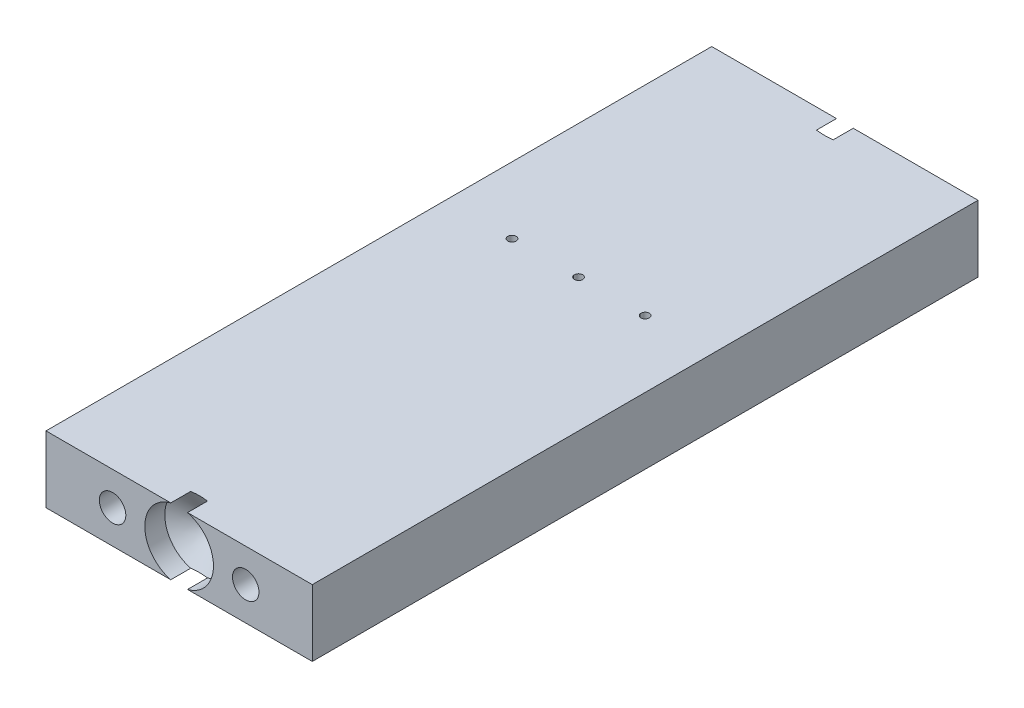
ISO-10303-21;
HEADER;
FILE_DESCRIPTION(('STEP AP214'),'2;1');
FILE_NAME('part.step','',(''),(''),'','','');
FILE_SCHEMA(('AUTOMOTIVE_DESIGN { 1 0 10303 214 1 1 1 1 }'));
ENDSEC;
DATA;
#1=APPLICATION_CONTEXT('core data for automotive mechanical design processes');
#2=APPLICATION_PROTOCOL_DEFINITION('international standard','automotive_design',2000,#1);
#3=PRODUCT_CONTEXT('',#1,'mechanical');
#4=PRODUCT('Part','Part','',(#3));
#5=PRODUCT_RELATED_PRODUCT_CATEGORY('part','',(#4));
#6=PRODUCT_DEFINITION_FORMATION('','',#4);
#7=PRODUCT_DEFINITION_CONTEXT('part definition',#1,'design');
#8=PRODUCT_DEFINITION('design','',#6,#7);
#9=PRODUCT_DEFINITION_SHAPE('','',#8);
#10=(LENGTH_UNIT() NAMED_UNIT(*) SI_UNIT(.MILLI.,.METRE.));
#11=(NAMED_UNIT(*) PLANE_ANGLE_UNIT() SI_UNIT($,.RADIAN.));
#12=(NAMED_UNIT(*) SI_UNIT($,.STERADIAN.) SOLID_ANGLE_UNIT());
#13=UNCERTAINTY_MEASURE_WITH_UNIT(LENGTH_MEASURE(1.E-05),#10,'distance_accuracy_value','');
#14=(GEOMETRIC_REPRESENTATION_CONTEXT(3) GLOBAL_UNCERTAINTY_ASSIGNED_CONTEXT((#13)) GLOBAL_UNIT_ASSIGNED_CONTEXT((#10,
#11,#12)) REPRESENTATION_CONTEXT('',''));
#15=CARTESIAN_POINT('',(0.,0.,0.));
#16=DIRECTION('',(0.,0.,1.));
#17=DIRECTION('',(1.,0.,0.));
#18=AXIS2_PLACEMENT_3D('',#15,#16,#17);
#19=CARTESIAN_POINT('',(-25.4,12.7,-63.5));
#20=DIRECTION('',(0.,0.,1.));
#21=DIRECTION('',(1.,0.,0.));
#22=AXIS2_PLACEMENT_3D('',#19,#20,#21);
#23=PLANE('',#22);
#24=CARTESIAN_POINT('',(-12.7,6.35,-63.5));
#25=DIRECTION('',(0.,0.,-1.));
#26=DIRECTION('',(-1.,0.,0.));
#27=AXIS2_PLACEMENT_3D('',#24,#25,#26);
#28=CIRCLE('',#27,2.52729999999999);
#29=CARTESIAN_POINT('',(-15.2273,6.35,-63.5));
#30=VERTEX_POINT('',#29);
#31=EDGE_CURVE('E582',#30,#30,#28,.T.);
#32=ORIENTED_EDGE('',*,*,#31,.F.);
#33=EDGE_LOOP('',(#32));
#34=FACE_BOUND('',#33,.T.);
#35=DIRECTION('',(-1.,0.,0.));
#36=VECTOR('',#35,1.);
#37=CARTESIAN_POINT('',(-25.4,12.7,-63.5));
#38=LINE('',#37,#36);
#39=CARTESIAN_POINT('',(-1.60011416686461,12.7,-63.5));
#40=VERTEX_POINT('',#39);
#41=CARTESIAN_POINT('',(-25.4,12.7,-63.5));
#42=VERTEX_POINT('',#41);
#43=EDGE_CURVE('E318',#40,#42,#38,.T.);
#44=ORIENTED_EDGE('',*,*,#43,.F.);
#45=CARTESIAN_POINT('',(0.,6.35,-63.5));
#46=DIRECTION('',(0.,0.,-1.));
#47=DIRECTION('',(-1.,0.,0.));
#48=AXIS2_PLACEMENT_3D('',#45,#46,#47);
#49=CIRCLE('',#48,6.54850099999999);
#50=CARTESIAN_POINT('',(-1.60011416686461,0.,-63.5));
#51=VERTEX_POINT('',#50);
#52=EDGE_CURVE('E263',#51,#40,#49,.T.);
#53=ORIENTED_EDGE('',*,*,#52,.F.);
#54=DIRECTION('',(-1.,0.,0.));
#55=VECTOR('',#54,1.);
#56=CARTESIAN_POINT('',(-25.4,0.,-63.5));
#57=LINE('',#56,#55);
#58=CARTESIAN_POINT('',(-25.4,0.,-63.5));
#59=VERTEX_POINT('',#58);
#60=EDGE_CURVE('E192',#51,#59,#57,.T.);
#61=ORIENTED_EDGE('',*,*,#60,.T.);
#62=DIRECTION('',(0.,-1.,0.));
#63=VECTOR('',#62,1.);
#64=CARTESIAN_POINT('',(-25.4,12.7,-63.5));
#65=LINE('',#64,#63);
#66=EDGE_CURVE('E211',#42,#59,#65,.T.);
#67=ORIENTED_EDGE('',*,*,#66,.F.);
#68=EDGE_LOOP('',(#44,#53,#61,#67));
#69=FACE_BOUND('',#68,.T.);
#70=ADVANCED_FACE('F37',(#34,#69),#23,.F.);
#71=CARTESIAN_POINT('',(-25.4,12.7,63.5));
#72=DIRECTION('',(0.,0.,-1.));
#73=DIRECTION('',(-1.,0.,0.));
#74=AXIS2_PLACEMENT_3D('',#71,#72,#73);
#75=PLANE('',#74);
#76=CARTESIAN_POINT('',(12.7,6.35,63.5));
#77=DIRECTION('',(0.,0.,1.));
#78=DIRECTION('',(1.,0.,0.));
#79=AXIS2_PLACEMENT_3D('',#76,#77,#78);
#80=CIRCLE('',#79,2.52729999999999);
#81=CARTESIAN_POINT('',(15.2273,6.35,63.5));
#82=VERTEX_POINT('',#81);
#83=EDGE_CURVE('E579',#82,#82,#80,.T.);
#84=ORIENTED_EDGE('',*,*,#83,.F.);
#85=EDGE_LOOP('',(#84));
#86=FACE_BOUND('',#85,.T.);
#87=DIRECTION('',(1.,0.,0.));
#88=VECTOR('',#87,1.);
#89=CARTESIAN_POINT('',(-25.4,12.7,63.5));
#90=LINE('',#89,#88);
#91=CARTESIAN_POINT('',(1.60011416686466,12.7,63.5));
#92=VERTEX_POINT('',#91);
#93=CARTESIAN_POINT('',(25.4,12.7,63.5));
#94=VERTEX_POINT('',#93);
#95=EDGE_CURVE('E327',#92,#94,#90,.T.);
#96=ORIENTED_EDGE('',*,*,#95,.F.);
#97=CARTESIAN_POINT('',(0.,6.35,63.5));
#98=DIRECTION('',(0.,0.,-1.));
#99=DIRECTION('',(-1.,0.,0.));
#100=AXIS2_PLACEMENT_3D('',#97,#98,#99);
#101=CIRCLE('',#100,6.548501);
#102=CARTESIAN_POINT('',(1.60011416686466,0.,63.5));
#103=VERTEX_POINT('',#102);
#104=EDGE_CURVE('E285',#92,#103,#101,.T.);
#105=ORIENTED_EDGE('',*,*,#104,.T.);
#106=DIRECTION('',(1.,0.,0.));
#107=VECTOR('',#106,1.);
#108=CARTESIAN_POINT('',(-25.4,0.,63.5));
#109=LINE('',#108,#107);
#110=CARTESIAN_POINT('',(25.4,0.,63.5));
#111=VERTEX_POINT('',#110);
#112=EDGE_CURVE('E194',#103,#111,#109,.T.);
#113=ORIENTED_EDGE('',*,*,#112,.T.);
#114=DIRECTION('',(0.,-1.,0.));
#115=VECTOR('',#114,1.);
#116=CARTESIAN_POINT('',(25.4,12.7,63.5));
#117=LINE('',#116,#115);
#118=EDGE_CURVE('E204',#94,#111,#117,.T.);
#119=ORIENTED_EDGE('',*,*,#118,.F.);
#120=EDGE_LOOP('',(#96,#105,#113,#119));
#121=FACE_BOUND('',#120,.T.);
#122=ADVANCED_FACE('F154',(#86,#121),#75,.F.);
#123=CARTESIAN_POINT('',(25.4,12.7,63.5));
#124=DIRECTION('',(-1.,0.,0.));
#125=DIRECTION('',(0.,0.,1.));
#126=AXIS2_PLACEMENT_3D('',#123,#124,#125);
#127=PLANE('',#126);
#128=DIRECTION('',(0.,0.,-1.));
#129=VECTOR('',#128,1.);
#130=CARTESIAN_POINT('',(25.4,0.,63.5));
#131=LINE('',#130,#129);
#132=CARTESIAN_POINT('',(25.4,0.,-63.5));
#133=VERTEX_POINT('',#132);
#134=EDGE_CURVE('E196',#111,#133,#131,.T.);
#135=ORIENTED_EDGE('',*,*,#134,.T.);
#136=DIRECTION('',(0.,-1.,0.));
#137=VECTOR('',#136,1.);
#138=CARTESIAN_POINT('',(25.4,12.7,-63.5));
#139=LINE('',#138,#137);
#140=CARTESIAN_POINT('',(25.4,12.7,-63.5));
#141=VERTEX_POINT('',#140);
#142=EDGE_CURVE('E186',#141,#133,#139,.T.);
#143=ORIENTED_EDGE('',*,*,#142,.F.);
#144=DIRECTION('',(0.,0.,-1.));
#145=VECTOR('',#144,1.);
#146=CARTESIAN_POINT('',(25.4,12.7,63.5));
#147=LINE('',#146,#145);
#148=EDGE_CURVE('E203',#94,#141,#147,.T.);
#149=ORIENTED_EDGE('',*,*,#148,.F.);
#150=ORIENTED_EDGE('',*,*,#118,.T.);
#151=EDGE_LOOP('',(#135,#143,#149,#150));
#152=FACE_BOUND('',#151,.T.);
#153=ADVANCED_FACE('F39',(#152),#127,.F.);
#154=CARTESIAN_POINT('',(12.7,6.35,-63.5));
#155=DIRECTION('',(0.,0.,-1.));
#156=DIRECTION('',(-1.,0.,0.));
#157=AXIS2_PLACEMENT_3D('',#154,#155,#156);
#158=CIRCLE('',#157,2.52729999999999);
#159=CARTESIAN_POINT('',(10.1727,6.35,-63.5));
#160=VERTEX_POINT('',#159);
#161=EDGE_CURVE('E178',#160,#160,#158,.T.);
#162=ORIENTED_EDGE('',*,*,#161,.F.);
#163=EDGE_LOOP('',(#162));
#164=FACE_BOUND('',#163,.T.);
#165=CARTESIAN_POINT('',(1.60011416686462,0.,-63.5));
#166=VERTEX_POINT('',#165);
#167=EDGE_CURVE('E182',#133,#166,#57,.T.);
#168=ORIENTED_EDGE('',*,*,#167,.T.);
#169=CARTESIAN_POINT('',(1.60011416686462,12.7,-63.5));
#170=VERTEX_POINT('',#169);
#171=EDGE_CURVE('E183',#170,#166,#49,.T.);
#172=ORIENTED_EDGE('',*,*,#171,.F.);
#173=EDGE_CURVE('E320',#141,#170,#38,.T.);
#174=ORIENTED_EDGE('',*,*,#173,.F.);
#175=ORIENTED_EDGE('',*,*,#142,.T.);
#176=EDGE_LOOP('',(#168,#172,#174,#175));
#177=FACE_BOUND('',#176,.T.);
#178=ADVANCED_FACE('F156',(#164,#177),#23,.F.);
#179=CARTESIAN_POINT('',(-25.4,12.7,63.5));
#180=DIRECTION('',(1.,0.,0.));
#181=DIRECTION('',(0.,0.,-1.));
#182=AXIS2_PLACEMENT_3D('',#179,#180,#181);
#183=PLANE('',#182);
#184=DIRECTION('',(0.,0.,1.));
#185=VECTOR('',#184,1.);
#186=CARTESIAN_POINT('',(-25.4,0.,63.5));
#187=LINE('',#186,#185);
#188=CARTESIAN_POINT('',(-25.4,0.,63.5));
#189=VERTEX_POINT('',#188);
#190=EDGE_CURVE('E191',#59,#189,#187,.T.);
#191=ORIENTED_EDGE('',*,*,#190,.T.);
#192=DIRECTION('',(0.,-1.,0.));
#193=VECTOR('',#192,1.);
#194=CARTESIAN_POINT('',(-25.4,12.7,63.5));
#195=LINE('',#194,#193);
#196=CARTESIAN_POINT('',(-25.4,12.7,63.5));
#197=VERTEX_POINT('',#196);
#198=EDGE_CURVE('E207',#197,#189,#195,.T.);
#199=ORIENTED_EDGE('',*,*,#198,.F.);
#200=DIRECTION('',(0.,0.,1.));
#201=VECTOR('',#200,1.);
#202=CARTESIAN_POINT('',(-25.4,12.7,63.5));
#203=LINE('',#202,#201);
#204=EDGE_CURVE('E326',#42,#197,#203,.T.);
#205=ORIENTED_EDGE('',*,*,#204,.F.);
#206=ORIENTED_EDGE('',*,*,#66,.T.);
#207=EDGE_LOOP('',(#191,#199,#205,#206));
#208=FACE_BOUND('',#207,.T.);
#209=ADVANCED_FACE('F167',(#208),#183,.F.);
#210=CARTESIAN_POINT('',(-12.7,6.35,63.5));
#211=DIRECTION('',(0.,0.,1.));
#212=DIRECTION('',(1.,0.,0.));
#213=AXIS2_PLACEMENT_3D('',#210,#211,#212);
#214=CIRCLE('',#213,2.52729999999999);
#215=CARTESIAN_POINT('',(-10.1727,6.35,63.5));
#216=VERTEX_POINT('',#215);
#217=EDGE_CURVE('E573',#216,#216,#214,.T.);
#218=ORIENTED_EDGE('',*,*,#217,.F.);
#219=EDGE_LOOP('',(#218));
#220=FACE_BOUND('',#219,.T.);
#221=CARTESIAN_POINT('',(-1.60011416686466,0.,63.5));
#222=VERTEX_POINT('',#221);
#223=EDGE_CURVE('E200',#189,#222,#109,.T.);
#224=ORIENTED_EDGE('',*,*,#223,.T.);
#225=CARTESIAN_POINT('',(-1.60011416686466,12.7,63.5));
#226=VERTEX_POINT('',#225);
#227=EDGE_CURVE('E286',#222,#226,#101,.T.);
#228=ORIENTED_EDGE('',*,*,#227,.T.);
#229=EDGE_CURVE('E208',#197,#226,#90,.T.);
#230=ORIENTED_EDGE('',*,*,#229,.F.);
#231=ORIENTED_EDGE('',*,*,#198,.T.);
#232=EDGE_LOOP('',(#224,#228,#230,#231));
#233=FACE_BOUND('',#232,.T.);
#234=ADVANCED_FACE('F162',(#220,#233),#75,.F.);
#235=CARTESIAN_POINT('',(0.,12.7,0.));
#236=DIRECTION('',(0.,-1.,0.));
#237=DIRECTION('',(0.,0.,-1.));
#238=AXIS2_PLACEMENT_3D('',#235,#236,#237);
#239=PLANE('',#238);
#240=CARTESIAN_POINT('',(0.,12.7,-12.7));
#241=DIRECTION('',(0.,1.,0.));
#242=DIRECTION('',(0.,0.,1.));
#243=AXIS2_PLACEMENT_3D('',#240,#241,#242);
#244=CIRCLE('',#243,0.793749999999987);
#245=CARTESIAN_POINT('',(0.,12.7,-11.90625));
#246=VERTEX_POINT('',#245);
#247=EDGE_CURVE('E591',#246,#246,#244,.T.);
#248=ORIENTED_EDGE('',*,*,#247,.F.);
#249=EDGE_LOOP('',(#248));
#250=FACE_BOUND('',#249,.T.);
#251=CARTESIAN_POINT('',(12.7,12.7,-12.7));
#252=DIRECTION('',(0.,1.,0.));
#253=DIRECTION('',(0.,0.,1.));
#254=AXIS2_PLACEMENT_3D('',#251,#252,#253);
#255=CIRCLE('',#254,0.793749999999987);
#256=CARTESIAN_POINT('',(12.7,12.7,-11.90625));
#257=VERTEX_POINT('',#256);
#258=EDGE_CURVE('E597',#257,#257,#255,.T.);
#259=ORIENTED_EDGE('',*,*,#258,.F.);
#260=EDGE_LOOP('',(#259));
#261=FACE_BOUND('',#260,.T.);
#262=CARTESIAN_POINT('',(-12.7,12.7,-12.7));
#263=DIRECTION('',(0.,1.,0.));
#264=DIRECTION('',(0.,0.,1.));
#265=AXIS2_PLACEMENT_3D('',#262,#263,#264);
#266=CIRCLE('',#265,0.793749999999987);
#267=CARTESIAN_POINT('',(-12.7,12.7,-11.90625));
#268=VERTEX_POINT('',#267);
#269=EDGE_CURVE('E602',#268,#268,#266,.T.);
#270=ORIENTED_EDGE('',*,*,#269,.F.);
#271=EDGE_LOOP('',(#270));
#272=FACE_BOUND('',#271,.T.);
#273=CARTESIAN_POINT('',(15.4687298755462,12.7,-65.8024743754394));
#274=CARTESIAN_POINT('',(15.0979794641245,12.7,-65.5964182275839));
#275=CARTESIAN_POINT('',(14.7267932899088,12.7,-65.3911404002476));
#276=CARTESIAN_POINT('',(13.9833051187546,12.7,-64.9825803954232));
#277=CARTESIAN_POINT('',(13.6110030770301,12.7,-64.7792982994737));
#278=CARTESIAN_POINT('',(12.8644515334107,12.7,-64.374851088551));
#279=CARTESIAN_POINT('',(12.4901998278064,12.7,-64.1736900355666));
#280=CARTESIAN_POINT('',(11.7400526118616,12.7,-63.7744679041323));
#281=CARTESIAN_POINT('',(11.3641571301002,12.7,-63.5764067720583));
#282=CARTESIAN_POINT('',(10.5925057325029,12.7,-63.1749706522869));
#283=CARTESIAN_POINT('',(10.1966503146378,12.7,-62.9717865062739));
#284=CARTESIAN_POINT('',(9.40206683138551,12.7,-62.5711161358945));
#285=CARTESIAN_POINT('',(9.00333883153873,12.7,-62.3736297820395));
#286=CARTESIAN_POINT('',(8.20242359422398,12.7,-61.9864428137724));
#287=CARTESIAN_POINT('',(7.80023874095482,12.7,-61.796737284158));
#288=CARTESIAN_POINT('',(6.99107792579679,12.7,-61.4278455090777));
#289=CARTESIAN_POINT('',(6.58410254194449,12.7,-61.2486580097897));
#290=CARTESIAN_POINT('',(5.974362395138,12.7,-60.9932789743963));
#291=CARTESIAN_POINT('',(5.77397230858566,12.7,-60.9114190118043));
#292=CARTESIAN_POINT('',(5.37152632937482,12.7,-60.7519129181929));
#293=CARTESIAN_POINT('',(5.1694705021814,12.7,-60.6742666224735));
#294=CARTESIAN_POINT('',(4.76339286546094,12.7,-60.5239484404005));
#295=CARTESIAN_POINT('',(4.55937016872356,12.7,-60.4512789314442));
#296=CARTESIAN_POINT('',(4.14930485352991,12.7,-60.311936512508));
#297=CARTESIAN_POINT('',(3.9432622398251,12.7,-60.2452635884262));
#298=CARTESIAN_POINT('',(3.32644814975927,12.7,-60.0573178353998));
#299=CARTESIAN_POINT('',(2.91236377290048,12.7,-59.9463549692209));
#300=CARTESIAN_POINT('',(2.28519430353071,12.7,-59.808595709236));
#301=CARTESIAN_POINT('',(2.07522529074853,12.7,-59.7674687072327));
#302=CARTESIAN_POINT('',(1.65343490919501,12.7,-59.6960772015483));
#303=CARTESIAN_POINT('',(1.44161375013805,12.7,-59.6658114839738));
#304=CARTESIAN_POINT('',(1.06491203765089,12.7,-59.622796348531));
#305=CARTESIAN_POINT('',(0.900305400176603,12.7,-59.6076291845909));
#306=CARTESIAN_POINT('',(0.570573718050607,12.7,-59.5848367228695));
#307=CARTESIAN_POINT('',(0.405448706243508,12.7,-59.5772109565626));
#308=CARTESIAN_POINT('',(0.0751138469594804,12.7,-59.5697073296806));
#309=CARTESIAN_POINT('',(-0.0900959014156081,12.7,-59.5698251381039));
#310=CARTESIAN_POINT('',(-0.420330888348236,12.7,-59.5777927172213));
#311=CARTESIAN_POINT('',(-0.585356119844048,12.7,-59.5856427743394));
#312=CARTESIAN_POINT('',(-0.945779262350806,12.7,-59.6110507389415));
#313=CARTESIAN_POINT('',(-1.14106956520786,12.7,-59.6301530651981));
#314=CARTESIAN_POINT('',(-1.53040461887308,12.7,-59.6783037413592));
#315=CARTESIAN_POINT('',(-1.7244492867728,12.7,-59.7073527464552));
#316=CARTESIAN_POINT('',(-2.30449482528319,12.7,-59.8081216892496));
#317=CARTESIAN_POINT('',(-2.68817906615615,12.7,-59.8934455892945));
#318=CARTESIAN_POINT('',(-3.26077605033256,12.7,-60.0431077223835));
#319=CARTESIAN_POINT('',(-3.45255626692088,12.7,-60.0970881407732));
#320=CARTESIAN_POINT('',(-3.83428337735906,12.7,-60.211237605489));
#321=CARTESIAN_POINT('',(-4.02423025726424,12.7,-60.2714066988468));
#322=CARTESIAN_POINT('',(-4.40230882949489,12.7,-60.3970044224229));
#323=CARTESIAN_POINT('',(-4.59044096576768,12.7,-60.4624317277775));
#324=CARTESIAN_POINT('',(-4.96507055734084,12.7,-60.5977690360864));
#325=CARTESIAN_POINT('',(-5.15156809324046,12.7,-60.6676788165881));
#326=CARTESIAN_POINT('',(-5.55510433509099,12.7,-60.8236882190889));
#327=CARTESIAN_POINT('',(-5.77186653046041,12.7,-60.9105014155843));
#328=CARTESIAN_POINT('',(-6.20360283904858,12.7,-61.0884755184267));
#329=CARTESIAN_POINT('',(-6.4185768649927,12.7,-61.1796366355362));
#330=CARTESIAN_POINT('',(-7.06123869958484,12.7,-61.4585484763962));
#331=CARTESIAN_POINT('',(-7.48658409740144,12.7,-61.6516952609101));
#332=CARTESIAN_POINT('',(-8.33285962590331,12.7,-62.0482312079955));
#333=CARTESIAN_POINT('',(-8.75378574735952,12.7,-62.2516288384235));
#334=CARTESIAN_POINT('',(-9.59196780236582,12.7,-62.6657224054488));
#335=CARTESIAN_POINT('',(-10.0092241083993,12.7,-62.8764175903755));
#336=CARTESIAN_POINT('',(-10.8422246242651,12.7,-63.3038840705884));
#337=CARTESIAN_POINT('',(-11.2579602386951,12.7,-63.5206720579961));
#338=CARTESIAN_POINT('',(-12.0872544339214,12.7,-63.9583866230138));
#339=CARTESIAN_POINT('',(-12.5008129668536,12.7,-64.1793132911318));
#340=CARTESIAN_POINT('',(-13.3260044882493,12.7,-64.6242550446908));
#341=CARTESIAN_POINT('',(-13.7376383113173,12.7,-64.8482685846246));
#342=CARTESIAN_POINT('',(-14.5595255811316,12.7,-65.2988153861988));
#343=CARTESIAN_POINT('',(-14.9697790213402,12.7,-65.525348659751));
#344=CARTESIAN_POINT('',(-16.1025018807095,12.7,-66.1544328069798));
#345=CARTESIAN_POINT('',(-16.8237947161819,12.7,-66.5591013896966));
#346=CARTESIAN_POINT('',(-18.2640268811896,12.7,-67.372829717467));
#347=CARTESIAN_POINT('',(-18.9829658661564,12.7,-67.7818900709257));
#348=CARTESIAN_POINT('',(-20.4148912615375,12.7,-68.6007916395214));
#349=CARTESIAN_POINT('',(-21.1278880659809,12.7,-69.0106146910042));
#350=CARTESIAN_POINT('',(-22.1963165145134,12.7,-69.6270671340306));
#351=CARTESIAN_POINT('',(-22.5522536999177,12.7,-69.8328214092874));
#352=CARTESIAN_POINT('',(-23.2638300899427,12.7,-70.2448436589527));
#353=CARTESIAN_POINT('',(-23.6194692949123,12.7,-70.4511116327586));
#354=CARTESIAN_POINT('',(-23.9749793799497,12.7,-70.6576019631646));
#355=B_SPLINE_CURVE_WITH_KNOTS('',3,(#273,#274,#275,#276,#277,#278,#279,#280,#281,#282,#283,
#284,#285,#286,#287,#288,#289,#290,#291,#292,#293,#294,#295,#296,#297,#298,#299,#300,#301,#302,
#303,#304,#305,#306,#307,#308,#309,#310,#311,#312,#313,#314,#315,#316,#317,#318,#319,#320,#321,
#322,#323,#324,#325,#326,#327,#328,#329,#330,#331,#332,#333,#334,#335,#336,#337,#338,#339,#340,
#341,#342,#343,#344,#345,#346,#347,#348,#349,#350,#351,#352,#353,#354),.UNSPECIFIED.,.F.,.F.,(4,
2,2,2,2,2,2,2,2,2,2,2,2,2,2,2,2,2,2,2,2,2,2,2,2,2,2,2,2,2,2,2,2,2,2,2,2,2,2,2,4),(0.,
1.27249489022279,2.54504155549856,3.81969501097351,5.09432639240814,6.42915913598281,
7.7639615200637,9.09790728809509,10.4316937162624,11.0810513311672,11.7303835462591,
12.3800238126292,13.0296625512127,14.3141084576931,14.9557615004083,15.5973428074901,
16.0930964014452,16.5888191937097,17.0842647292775,17.5797286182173,18.1681048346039,
18.7565198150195,19.9340335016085,20.5316700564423,21.1293111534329,21.7268021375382,
22.3242634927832,23.0247054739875,23.7251814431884,25.1263982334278,26.5287921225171,
27.9310419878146,29.3376038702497,30.74419654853,32.1501088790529,33.5560278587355,
36.037168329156,38.5186570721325,40.9858099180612,42.2191931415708,43.4525749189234),.UNSPECIFIED.);
#356=CARTESIAN_POINT('',(1.60011416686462,12.7,-59.69));
#357=VERTEX_POINT('',#356);
#358=CARTESIAN_POINT('',(-1.60011416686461,12.7,-59.69));
#359=VERTEX_POINT('',#358);
#360=EDGE_CURVE('E278',#357,#359,#355,.T.);
#361=ORIENTED_EDGE('',*,*,#360,.T.);
#362=DIRECTION('',(0.,0.,-1.));
#363=VECTOR('',#362,1.);
#364=CARTESIAN_POINT('',(-1.60011416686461,12.7,-63.5));
#365=LINE('',#364,#363);
#366=EDGE_CURVE('E274',#359,#40,#365,.T.);
#367=ORIENTED_EDGE('',*,*,#366,.T.);
#368=ORIENTED_EDGE('',*,*,#43,.T.);
#369=ORIENTED_EDGE('',*,*,#204,.T.);
#370=ORIENTED_EDGE('',*,*,#229,.T.);
#371=DIRECTION('',(0.,0.,1.));
#372=VECTOR('',#371,1.);
#373=CARTESIAN_POINT('',(-1.60011416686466,12.7,63.5));
#374=LINE('',#373,#372);
#375=CARTESIAN_POINT('',(-1.60011416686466,12.7,59.69));
#376=VERTEX_POINT('',#375);
#377=EDGE_CURVE('E224',#226,#376,#374,.F.);
#378=ORIENTED_EDGE('',*,*,#377,.T.);
#379=CARTESIAN_POINT('',(-23.9749793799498,12.7,70.6576019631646));
#380=CARTESIAN_POINT('',(-23.3288081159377,12.7,70.2823216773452));
#381=CARTESIAN_POINT('',(-22.6822340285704,12.7,69.9077311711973));
#382=CARTESIAN_POINT('',(-21.3879497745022,12.7,69.1604356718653));
#383=CARTESIAN_POINT('',(-20.7402395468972,12.7,68.7877307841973));
#384=CARTESIAN_POINT('',(-19.4419324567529,12.7,68.0438995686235));
#385=CARTESIAN_POINT('',(-18.7913323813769,12.7,67.6727788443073));
#386=CARTESIAN_POINT('',(-17.4883131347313,12.7,66.9338073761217));
#387=CARTESIAN_POINT('',(-16.835894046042,12.7,66.5659564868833));
#388=CARTESIAN_POINT('',(-15.8069115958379,12.7,65.9904138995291));
#389=CARTESIAN_POINT('',(-15.4311857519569,12.7,65.7812251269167));
#390=CARTESIAN_POINT('',(-14.6787383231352,12.7,65.3646469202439));
#391=CARTESIAN_POINT('',(-14.3020167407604,12.7,65.157257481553));
#392=CARTESIAN_POINT('',(-13.5473031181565,12.7,64.7446565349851));
#393=CARTESIAN_POINT('',(-13.1693108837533,12.7,64.5394453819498));
#394=CARTESIAN_POINT('',(-12.4118412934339,12.7,64.1317847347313));
#395=CARTESIAN_POINT('',(-12.0323639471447,12.7,63.929335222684));
#396=CARTESIAN_POINT('',(-11.2720030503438,12.7,63.5281678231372));
#397=CARTESIAN_POINT('',(-10.891121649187,12.7,63.3294458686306));
#398=CARTESIAN_POINT('',(-10.1270277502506,12.7,62.9364933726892));
#399=CARTESIAN_POINT('',(-9.74381518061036,12.7,62.7422629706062));
#400=CARTESIAN_POINT('',(-8.97454694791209,12.7,62.3597671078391));
#401=CARTESIAN_POINT('',(-8.58849208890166,12.7,62.1715000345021));
#402=CARTESIAN_POINT('',(-7.81262817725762,12.7,61.8028919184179));
#403=CARTESIAN_POINT('',(-7.42281943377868,12.7,61.6225502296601));
#404=CARTESIAN_POINT('',(-6.77607373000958,12.7,61.3341730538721));
#405=CARTESIAN_POINT('',(-6.52054503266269,12.7,61.2229846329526));
#406=CARTESIAN_POINT('',(-6.00706193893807,12.7,61.0063123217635));
#407=CARTESIAN_POINT('',(-5.7491074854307,12.7,60.900828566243));
#408=CARTESIAN_POINT('',(-5.23018355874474,12.7,60.6969089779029));
#409=CARTESIAN_POINT('',(-4.96921192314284,12.7,60.5984786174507));
#410=CARTESIAN_POINT('',(-4.44404042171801,12.7,60.4105760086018));
#411=CARTESIAN_POINT('',(-4.17984058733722,12.7,60.3211036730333));
#412=CARTESIAN_POINT('',(-3.65649302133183,12.7,60.1561097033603));
#413=CARTESIAN_POINT('',(-3.39745927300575,12.7,60.0802297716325));
#414=CARTESIAN_POINT('',(-2.87588317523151,12.7,59.9414372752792));
#415=CARTESIAN_POINT('',(-2.61334067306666,12.7,59.8785252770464));
#416=CARTESIAN_POINT('',(-2.08541640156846,12.7,59.7684694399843));
#417=CARTESIAN_POINT('',(-1.82004054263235,12.7,59.7212976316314));
#418=CARTESIAN_POINT('',(-1.28670564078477,12.7,59.6451662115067));
#419=CARTESIAN_POINT('',(-1.01874752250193,12.7,59.6162003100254));
#420=CARTESIAN_POINT('',(-0.605918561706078,12.7,59.5870892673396));
#421=CARTESIAN_POINT('',(-0.461524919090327,12.7,59.5798091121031));
#422=CARTESIAN_POINT('',(-0.172564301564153,12.7,59.5711534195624));
#423=CARTESIAN_POINT('',(-0.0279973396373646,12.7,59.5697774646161));
#424=CARTESIAN_POINT('',(0.261085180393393,12.7,59.5729647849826));
#425=CARTESIAN_POINT('',(0.405600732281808,12.7,59.5775286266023));
#426=CARTESIAN_POINT('',(0.694321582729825,12.7,59.5924946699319));
#427=CARTESIAN_POINT('',(0.838526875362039,12.7,59.6028969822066));
#428=CARTESIAN_POINT('',(1.27564055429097,12.7,59.6430700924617));
#429=CARTESIAN_POINT('',(1.56777919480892,12.7,59.6817411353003));
#430=CARTESIAN_POINT('',(2.00321223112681,12.7,59.7552013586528));
#431=CARTESIAN_POINT('',(2.14789135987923,12.7,59.782263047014));
#432=CARTESIAN_POINT('',(2.43628225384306,12.7,59.8410986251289));
#433=CARTESIAN_POINT('',(2.5799940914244,12.7,59.8728721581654));
#434=CARTESIAN_POINT('',(3.0193405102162,12.7,59.9769151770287));
#435=CARTESIAN_POINT('',(3.31332319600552,12.7,60.0561954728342));
#436=CARTESIAN_POINT('',(3.89700064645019,12.7,60.2293404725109));
#437=CARTESIAN_POINT('',(4.18669367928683,12.7,60.32321089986));
#438=CARTESIAN_POINT('',(4.76253572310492,12.7,60.5225076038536));
#439=CARTESIAN_POINT('',(5.04867870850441,12.7,60.6279511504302));
#440=CARTESIAN_POINT('',(5.61745572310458,12.7,60.8477443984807));
#441=CARTESIAN_POINT('',(5.90009017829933,12.7,60.9620930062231));
#442=CARTESIAN_POINT('',(6.46447224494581,12.7,61.198634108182));
#443=CARTESIAN_POINT('',(6.74619828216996,12.7,61.320877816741));
#444=CARTESIAN_POINT('',(7.30715710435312,12.7,61.5709519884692));
#445=CARTESIAN_POINT('',(7.58638983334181,12.7,61.6987825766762));
#446=CARTESIAN_POINT('',(8.14254869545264,12.7,61.9587853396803));
#447=CARTESIAN_POINT('',(8.41947649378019,12.7,62.0909539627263));
#448=CARTESIAN_POINT('',(8.97158830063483,12.7,62.3588683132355));
#449=CARTESIAN_POINT('',(9.24677232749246,12.7,62.494614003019));
#450=CARTESIAN_POINT('',(10.0274471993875,12.7,62.8848471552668));
#451=CARTESIAN_POINT('',(10.5311989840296,12.7,63.142811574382));
#452=CARTESIAN_POINT('',(11.5352031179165,12.7,63.6656801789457));
#453=CARTESIAN_POINT('',(12.0354547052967,12.7,63.9305858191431));
#454=CARTESIAN_POINT('',(13.0257105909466,12.7,64.4613661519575));
#455=CARTESIAN_POINT('',(13.5157553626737,12.7,64.7271654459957));
#456=CARTESIAN_POINT('',(14.2492502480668,12.7,65.1285643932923));
#457=CARTESIAN_POINT('',(14.4934518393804,12.7,65.2627947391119));
#458=CARTESIAN_POINT('',(14.9814100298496,12.7,65.53205883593));
#459=CARTESIAN_POINT('',(15.2251666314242,12.7,65.6670925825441));
#460=CARTESIAN_POINT('',(15.4687298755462,12.7,65.8024743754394));
#461=B_SPLINE_CURVE_WITH_KNOTS('',3,(#379,#380,#381,#382,#383,#384,#385,#386,#387,#388,#389,
#390,#391,#392,#393,#394,#395,#396,#397,#398,#399,#400,#401,#402,#403,#404,#405,#406,#407,#408,
#409,#410,#411,#412,#413,#414,#415,#416,#417,#418,#419,#420,#421,#422,#423,#424,#425,#426,#427,
#428,#429,#430,#431,#432,#433,#434,#435,#436,#437,#438,#439,#440,#441,#442,#443,#444,#445,#446,
#447,#448,#449,#450,#451,#452,#453,#454,#455,#456,#457,#458,#459,#460),.UNSPECIFIED.,.F.,.F.,(4,
2,2,2,2,2,2,2,2,2,2,2,2,2,2,2,2,2,2,2,2,2,2,2,2,2,2,2,2,2,2,2,2,2,2,2,2,2,2,2,4),(0.,
2.24173250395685,4.48358909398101,6.73060283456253,8.97751617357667,10.2676165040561,
11.5577135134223,12.8480175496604,14.1383132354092,15.4271079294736,16.715942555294,
18.0044256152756,19.2928034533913,20.1287646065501,20.9647454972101,21.8013681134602,
22.6379825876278,23.4474682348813,24.2569892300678,25.065063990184,25.8728594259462,
26.3064861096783,26.7400821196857,27.1737194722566,27.6073650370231,28.4904152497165,
28.9319235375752,29.3733984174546,30.2863235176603,31.1996076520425,32.1142736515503,
33.0288274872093,33.9500646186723,34.8713223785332,35.7918438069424,36.7123555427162,
38.4101505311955,40.1083042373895,41.7807468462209,42.616730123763,43.4527088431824),.UNSPECIFIED.);
#462=CARTESIAN_POINT('',(1.60011416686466,12.7,59.69));
#463=VERTEX_POINT('',#462);
#464=EDGE_CURVE('E215',#376,#463,#461,.T.);
#465=ORIENTED_EDGE('',*,*,#464,.T.);
#466=DIRECTION('',(0.,0.,1.));
#467=VECTOR('',#466,1.);
#468=CARTESIAN_POINT('',(1.60011416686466,12.7,63.5));
#469=LINE('',#468,#467);
#470=EDGE_CURVE('E292',#463,#92,#469,.T.);
#471=ORIENTED_EDGE('',*,*,#470,.T.);
#472=ORIENTED_EDGE('',*,*,#95,.T.);
#473=ORIENTED_EDGE('',*,*,#148,.T.);
#474=ORIENTED_EDGE('',*,*,#173,.T.);
#475=DIRECTION('',(0.,0.,-1.));
#476=VECTOR('',#475,1.);
#477=CARTESIAN_POINT('',(1.60011416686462,12.7,-63.5));
#478=LINE('',#477,#476);
#479=EDGE_CURVE('E270',#170,#357,#478,.F.);
#480=ORIENTED_EDGE('',*,*,#479,.T.);
#481=EDGE_LOOP('',(#361,#367,#368,#369,#370,#378,#465,#471,#472,#473,#474,#480));
#482=FACE_BOUND('',#481,.T.);
#483=ADVANCED_FACE('F226',(#250,#261,#272,#482),#239,.F.);
#484=CARTESIAN_POINT('',(0.,0.,0.));
#485=DIRECTION('',(0.,-1.,0.));
#486=DIRECTION('',(0.,0.,-1.));
#487=AXIS2_PLACEMENT_3D('',#484,#485,#486);
#488=PLANE('',#487);
#489=DIRECTION('',(0.,0.,-1.));
#490=VECTOR('',#489,1.);
#491=CARTESIAN_POINT('',(-1.60011416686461,0.,-63.5));
#492=LINE('',#491,#490);
#493=CARTESIAN_POINT('',(-1.60011416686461,0.,-59.69));
#494=VERTEX_POINT('',#493);
#495=EDGE_CURVE('E11',#494,#51,#492,.T.);
#496=ORIENTED_EDGE('',*,*,#495,.F.);
#497=CARTESIAN_POINT('',(15.4687298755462,0.,-65.8024743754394));
#498=CARTESIAN_POINT('',(15.0979794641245,0.,-65.5964182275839));
#499=CARTESIAN_POINT('',(14.7267932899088,0.,-65.3911404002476));
#500=CARTESIAN_POINT('',(13.9833051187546,0.,-64.9825803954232));
#501=CARTESIAN_POINT('',(13.6110030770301,0.,-64.7792982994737));
#502=CARTESIAN_POINT('',(12.8644515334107,0.,-64.374851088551));
#503=CARTESIAN_POINT('',(12.4901998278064,0.,-64.1736900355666));
#504=CARTESIAN_POINT('',(11.7400526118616,0.,-63.7744679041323));
#505=CARTESIAN_POINT('',(11.3641571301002,0.,-63.5764067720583));
#506=CARTESIAN_POINT('',(10.5925057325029,0.,-63.1749706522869));
#507=CARTESIAN_POINT('',(10.1966503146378,0.,-62.9717865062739));
#508=CARTESIAN_POINT('',(9.40206683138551,0.,-62.5711161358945));
#509=CARTESIAN_POINT('',(9.00333883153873,0.,-62.3736297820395));
#510=CARTESIAN_POINT('',(8.20242359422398,0.,-61.9864428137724));
#511=CARTESIAN_POINT('',(7.80023874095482,0.,-61.796737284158));
#512=CARTESIAN_POINT('',(6.99107792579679,0.,-61.4278455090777));
#513=CARTESIAN_POINT('',(6.58410254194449,0.,-61.2486580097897));
#514=CARTESIAN_POINT('',(5.974362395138,0.,-60.9932789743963));
#515=CARTESIAN_POINT('',(5.77397230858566,0.,-60.9114190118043));
#516=CARTESIAN_POINT('',(5.37152632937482,0.,-60.7519129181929));
#517=CARTESIAN_POINT('',(5.1694705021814,0.,-60.6742666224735));
#518=CARTESIAN_POINT('',(4.76339286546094,0.,-60.5239484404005));
#519=CARTESIAN_POINT('',(4.55937016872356,0.,-60.4512789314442));
#520=CARTESIAN_POINT('',(4.14930485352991,0.,-60.311936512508));
#521=CARTESIAN_POINT('',(3.9432622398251,0.,-60.2452635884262));
#522=CARTESIAN_POINT('',(3.32644814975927,0.,-60.0573178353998));
#523=CARTESIAN_POINT('',(2.91236377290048,0.,-59.9463549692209));
#524=CARTESIAN_POINT('',(2.28519430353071,0.,-59.808595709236));
#525=CARTESIAN_POINT('',(2.07522529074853,0.,-59.7674687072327));
#526=CARTESIAN_POINT('',(1.65343490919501,0.,-59.6960772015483));
#527=CARTESIAN_POINT('',(1.44161375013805,0.,-59.6658114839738));
#528=CARTESIAN_POINT('',(1.06491203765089,0.,-59.622796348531));
#529=CARTESIAN_POINT('',(0.900305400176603,0.,-59.6076291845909));
#530=CARTESIAN_POINT('',(0.570573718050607,0.,-59.5848367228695));
#531=CARTESIAN_POINT('',(0.405448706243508,0.,-59.5772109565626));
#532=CARTESIAN_POINT('',(0.0751138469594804,0.,-59.5697073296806));
#533=CARTESIAN_POINT('',(-0.0900959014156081,0.,-59.5698251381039));
#534=CARTESIAN_POINT('',(-0.420330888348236,0.,-59.5777927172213));
#535=CARTESIAN_POINT('',(-0.585356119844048,0.,-59.5856427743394));
#536=CARTESIAN_POINT('',(-0.945779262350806,0.,-59.6110507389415));
#537=CARTESIAN_POINT('',(-1.14106956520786,0.,-59.6301530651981));
#538=CARTESIAN_POINT('',(-1.53040461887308,0.,-59.6783037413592));
#539=CARTESIAN_POINT('',(-1.7244492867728,0.,-59.7073527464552));
#540=CARTESIAN_POINT('',(-2.30449482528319,0.,-59.8081216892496));
#541=CARTESIAN_POINT('',(-2.68817906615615,0.,-59.8934455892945));
#542=CARTESIAN_POINT('',(-3.26077605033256,0.,-60.0431077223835));
#543=CARTESIAN_POINT('',(-3.45255626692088,0.,-60.0970881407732));
#544=CARTESIAN_POINT('',(-3.83428337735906,0.,-60.211237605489));
#545=CARTESIAN_POINT('',(-4.02423025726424,0.,-60.2714066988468));
#546=CARTESIAN_POINT('',(-4.40230882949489,0.,-60.3970044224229));
#547=CARTESIAN_POINT('',(-4.59044096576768,0.,-60.4624317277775));
#548=CARTESIAN_POINT('',(-4.96507055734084,0.,-60.5977690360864));
#549=CARTESIAN_POINT('',(-5.15156809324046,0.,-60.6676788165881));
#550=CARTESIAN_POINT('',(-5.55510433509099,0.,-60.8236882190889));
#551=CARTESIAN_POINT('',(-5.77186653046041,0.,-60.9105014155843));
#552=CARTESIAN_POINT('',(-6.20360283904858,0.,-61.0884755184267));
#553=CARTESIAN_POINT('',(-6.4185768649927,0.,-61.1796366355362));
#554=CARTESIAN_POINT('',(-7.06123869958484,0.,-61.4585484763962));
#555=CARTESIAN_POINT('',(-7.48658409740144,0.,-61.6516952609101));
#556=CARTESIAN_POINT('',(-8.33285962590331,0.,-62.0482312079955));
#557=CARTESIAN_POINT('',(-8.75378574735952,0.,-62.2516288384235));
#558=CARTESIAN_POINT('',(-9.59196780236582,0.,-62.6657224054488));
#559=CARTESIAN_POINT('',(-10.0092241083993,0.,-62.8764175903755));
#560=CARTESIAN_POINT('',(-10.8422246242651,0.,-63.3038840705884));
#561=CARTESIAN_POINT('',(-11.2579602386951,0.,-63.5206720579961));
#562=CARTESIAN_POINT('',(-12.0872544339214,0.,-63.9583866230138));
#563=CARTESIAN_POINT('',(-12.5008129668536,0.,-64.1793132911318));
#564=CARTESIAN_POINT('',(-13.3260044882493,0.,-64.6242550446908));
#565=CARTESIAN_POINT('',(-13.7376383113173,0.,-64.8482685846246));
#566=CARTESIAN_POINT('',(-14.5595255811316,0.,-65.2988153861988));
#567=CARTESIAN_POINT('',(-14.9697790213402,0.,-65.525348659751));
#568=CARTESIAN_POINT('',(-16.1025018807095,0.,-66.1544328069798));
#569=CARTESIAN_POINT('',(-16.8237947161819,0.,-66.5591013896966));
#570=CARTESIAN_POINT('',(-18.2640268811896,0.,-67.372829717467));
#571=CARTESIAN_POINT('',(-18.9829658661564,0.,-67.7818900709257));
#572=CARTESIAN_POINT('',(-20.4148912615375,0.,-68.6007916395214));
#573=CARTESIAN_POINT('',(-21.1278880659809,0.,-69.0106146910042));
#574=CARTESIAN_POINT('',(-22.1963165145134,0.,-69.6270671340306));
#575=CARTESIAN_POINT('',(-22.5522536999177,0.,-69.8328214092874));
#576=CARTESIAN_POINT('',(-23.2638300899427,0.,-70.2448436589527));
#577=CARTESIAN_POINT('',(-23.6194692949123,0.,-70.4511116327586));
#578=CARTESIAN_POINT('',(-23.9749793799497,0.,-70.6576019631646));
#579=B_SPLINE_CURVE_WITH_KNOTS('',3,(#497,#498,#499,#500,#501,#502,#503,#504,#505,#506,#507,
#508,#509,#510,#511,#512,#513,#514,#515,#516,#517,#518,#519,#520,#521,#522,#523,#524,#525,#526,
#527,#528,#529,#530,#531,#532,#533,#534,#535,#536,#537,#538,#539,#540,#541,#542,#543,#544,#545,
#546,#547,#548,#549,#550,#551,#552,#553,#554,#555,#556,#557,#558,#559,#560,#561,#562,#563,#564,
#565,#566,#567,#568,#569,#570,#571,#572,#573,#574,#575,#576,#577,#578),.UNSPECIFIED.,.F.,.F.,(4,
2,2,2,2,2,2,2,2,2,2,2,2,2,2,2,2,2,2,2,2,2,2,2,2,2,2,2,2,2,2,2,2,2,2,2,2,2,2,2,4),(0.,
1.27249489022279,2.54504155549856,3.81969501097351,5.09432639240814,6.42915913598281,
7.7639615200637,9.09790728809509,10.4316937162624,11.0810513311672,11.7303835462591,
12.3800238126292,13.0296625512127,14.3141084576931,14.9557615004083,15.5973428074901,
16.0930964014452,16.5888191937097,17.0842647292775,17.5797286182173,18.1681048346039,
18.7565198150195,19.9340335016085,20.5316700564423,21.1293111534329,21.7268021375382,
22.3242634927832,23.0247054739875,23.7251814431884,25.1263982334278,26.5287921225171,
27.9310419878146,29.3376038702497,30.74419654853,32.1501088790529,33.5560278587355,
36.037168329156,38.5186570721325,40.9858099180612,42.2191931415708,43.4525749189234),.UNSPECIFIED.);
#580=CARTESIAN_POINT('',(1.60011416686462,0.,-59.69));
#581=VERTEX_POINT('',#580);
#582=EDGE_CURVE('E255',#581,#494,#579,.T.);
#583=ORIENTED_EDGE('',*,*,#582,.F.);
#584=DIRECTION('',(0.,0.,-1.));
#585=VECTOR('',#584,1.);
#586=CARTESIAN_POINT('',(1.60011416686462,0.,-63.5));
#587=LINE('',#586,#585);
#588=EDGE_CURVE('E45',#166,#581,#587,.F.);
#589=ORIENTED_EDGE('',*,*,#588,.F.);
#590=ORIENTED_EDGE('',*,*,#167,.F.);
#591=ORIENTED_EDGE('',*,*,#134,.F.);
#592=ORIENTED_EDGE('',*,*,#112,.F.);
#593=DIRECTION('',(0.,0.,1.));
#594=VECTOR('',#593,1.);
#595=CARTESIAN_POINT('',(1.60011416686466,0.,63.5));
#596=LINE('',#595,#594);
#597=CARTESIAN_POINT('',(1.60011416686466,0.,59.69));
#598=VERTEX_POINT('',#597);
#599=EDGE_CURVE('E289',#598,#103,#596,.T.);
#600=ORIENTED_EDGE('',*,*,#599,.F.);
#601=CARTESIAN_POINT('',(-23.9749793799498,0.,70.6576019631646));
#602=CARTESIAN_POINT('',(-23.3288081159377,0.,70.2823216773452));
#603=CARTESIAN_POINT('',(-22.6822340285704,0.,69.9077311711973));
#604=CARTESIAN_POINT('',(-21.3879497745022,0.,69.1604356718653));
#605=CARTESIAN_POINT('',(-20.7402395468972,0.,68.7877307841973));
#606=CARTESIAN_POINT('',(-19.4419324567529,0.,68.0438995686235));
#607=CARTESIAN_POINT('',(-18.7913323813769,0.,67.6727788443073));
#608=CARTESIAN_POINT('',(-17.4883131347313,0.,66.9338073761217));
#609=CARTESIAN_POINT('',(-16.835894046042,0.,66.5659564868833));
#610=CARTESIAN_POINT('',(-15.8069115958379,0.,65.9904138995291));
#611=CARTESIAN_POINT('',(-15.4311857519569,0.,65.7812251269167));
#612=CARTESIAN_POINT('',(-14.6787383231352,0.,65.3646469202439));
#613=CARTESIAN_POINT('',(-14.3020167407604,0.,65.157257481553));
#614=CARTESIAN_POINT('',(-13.5473031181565,0.,64.7446565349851));
#615=CARTESIAN_POINT('',(-13.1693108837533,0.,64.5394453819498));
#616=CARTESIAN_POINT('',(-12.4118412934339,0.,64.1317847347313));
#617=CARTESIAN_POINT('',(-12.0323639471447,0.,63.929335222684));
#618=CARTESIAN_POINT('',(-11.2720030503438,0.,63.5281678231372));
#619=CARTESIAN_POINT('',(-10.891121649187,0.,63.3294458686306));
#620=CARTESIAN_POINT('',(-10.1270277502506,0.,62.9364933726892));
#621=CARTESIAN_POINT('',(-9.74381518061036,0.,62.7422629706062));
#622=CARTESIAN_POINT('',(-8.97454694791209,0.,62.3597671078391));
#623=CARTESIAN_POINT('',(-8.58849208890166,0.,62.1715000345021));
#624=CARTESIAN_POINT('',(-7.81262817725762,0.,61.8028919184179));
#625=CARTESIAN_POINT('',(-7.42281943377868,0.,61.6225502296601));
#626=CARTESIAN_POINT('',(-6.77607373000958,0.,61.3341730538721));
#627=CARTESIAN_POINT('',(-6.52054503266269,0.,61.2229846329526));
#628=CARTESIAN_POINT('',(-6.00706193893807,0.,61.0063123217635));
#629=CARTESIAN_POINT('',(-5.7491074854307,0.,60.900828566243));
#630=CARTESIAN_POINT('',(-5.23018355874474,0.,60.6969089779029));
#631=CARTESIAN_POINT('',(-4.96921192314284,0.,60.5984786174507));
#632=CARTESIAN_POINT('',(-4.44404042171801,0.,60.4105760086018));
#633=CARTESIAN_POINT('',(-4.17984058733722,0.,60.3211036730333));
#634=CARTESIAN_POINT('',(-3.65649302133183,0.,60.1561097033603));
#635=CARTESIAN_POINT('',(-3.39745927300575,0.,60.0802297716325));
#636=CARTESIAN_POINT('',(-2.87588317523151,0.,59.9414372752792));
#637=CARTESIAN_POINT('',(-2.61334067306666,0.,59.8785252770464));
#638=CARTESIAN_POINT('',(-2.08541640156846,0.,59.7684694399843));
#639=CARTESIAN_POINT('',(-1.82004054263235,0.,59.7212976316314));
#640=CARTESIAN_POINT('',(-1.28670564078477,0.,59.6451662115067));
#641=CARTESIAN_POINT('',(-1.01874752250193,0.,59.6162003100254));
#642=CARTESIAN_POINT('',(-0.605918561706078,0.,59.5870892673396));
#643=CARTESIAN_POINT('',(-0.461524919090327,0.,59.5798091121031));
#644=CARTESIAN_POINT('',(-0.172564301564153,0.,59.5711534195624));
#645=CARTESIAN_POINT('',(-0.0279973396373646,0.,59.5697774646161));
#646=CARTESIAN_POINT('',(0.261085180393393,0.,59.5729647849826));
#647=CARTESIAN_POINT('',(0.405600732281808,0.,59.5775286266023));
#648=CARTESIAN_POINT('',(0.694321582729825,0.,59.5924946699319));
#649=CARTESIAN_POINT('',(0.838526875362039,0.,59.6028969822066));
#650=CARTESIAN_POINT('',(1.27564055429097,0.,59.6430700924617));
#651=CARTESIAN_POINT('',(1.56777919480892,0.,59.6817411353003));
#652=CARTESIAN_POINT('',(2.00321223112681,0.,59.7552013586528));
#653=CARTESIAN_POINT('',(2.14789135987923,0.,59.782263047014));
#654=CARTESIAN_POINT('',(2.43628225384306,0.,59.8410986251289));
#655=CARTESIAN_POINT('',(2.5799940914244,0.,59.8728721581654));
#656=CARTESIAN_POINT('',(3.0193405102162,0.,59.9769151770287));
#657=CARTESIAN_POINT('',(3.31332319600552,0.,60.0561954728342));
#658=CARTESIAN_POINT('',(3.89700064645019,0.,60.2293404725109));
#659=CARTESIAN_POINT('',(4.18669367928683,0.,60.32321089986));
#660=CARTESIAN_POINT('',(4.76253572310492,0.,60.5225076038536));
#661=CARTESIAN_POINT('',(5.04867870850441,0.,60.6279511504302));
#662=CARTESIAN_POINT('',(5.61745572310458,0.,60.8477443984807));
#663=CARTESIAN_POINT('',(5.90009017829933,0.,60.9620930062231));
#664=CARTESIAN_POINT('',(6.46447224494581,0.,61.198634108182));
#665=CARTESIAN_POINT('',(6.74619828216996,0.,61.320877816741));
#666=CARTESIAN_POINT('',(7.30715710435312,0.,61.5709519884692));
#667=CARTESIAN_POINT('',(7.58638983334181,0.,61.6987825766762));
#668=CARTESIAN_POINT('',(8.14254869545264,0.,61.9587853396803));
#669=CARTESIAN_POINT('',(8.41947649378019,0.,62.0909539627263));
#670=CARTESIAN_POINT('',(8.97158830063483,0.,62.3588683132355));
#671=CARTESIAN_POINT('',(9.24677232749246,0.,62.494614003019));
#672=CARTESIAN_POINT('',(10.0274471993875,0.,62.8848471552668));
#673=CARTESIAN_POINT('',(10.5311989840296,0.,63.142811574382));
#674=CARTESIAN_POINT('',(11.5352031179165,0.,63.6656801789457));
#675=CARTESIAN_POINT('',(12.0354547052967,0.,63.9305858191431));
#676=CARTESIAN_POINT('',(13.0257105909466,0.,64.4613661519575));
#677=CARTESIAN_POINT('',(13.5157553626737,0.,64.7271654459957));
#678=CARTESIAN_POINT('',(14.2492502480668,0.,65.1285643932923));
#679=CARTESIAN_POINT('',(14.4934518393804,0.,65.2627947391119));
#680=CARTESIAN_POINT('',(14.9814100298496,0.,65.53205883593));
#681=CARTESIAN_POINT('',(15.2251666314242,0.,65.6670925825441));
#682=CARTESIAN_POINT('',(15.4687298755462,0.,65.8024743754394));
#683=B_SPLINE_CURVE_WITH_KNOTS('',3,(#601,#602,#603,#604,#605,#606,#607,#608,#609,#610,#611,
#612,#613,#614,#615,#616,#617,#618,#619,#620,#621,#622,#623,#624,#625,#626,#627,#628,#629,#630,
#631,#632,#633,#634,#635,#636,#637,#638,#639,#640,#641,#642,#643,#644,#645,#646,#647,#648,#649,
#650,#651,#652,#653,#654,#655,#656,#657,#658,#659,#660,#661,#662,#663,#664,#665,#666,#667,#668,
#669,#670,#671,#672,#673,#674,#675,#676,#677,#678,#679,#680,#681,#682),.UNSPECIFIED.,.F.,.F.,(4,
2,2,2,2,2,2,2,2,2,2,2,2,2,2,2,2,2,2,2,2,2,2,2,2,2,2,2,2,2,2,2,2,2,2,2,2,2,2,2,4),(0.,
2.24173250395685,4.48358909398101,6.73060283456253,8.97751617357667,10.2676165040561,
11.5577135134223,12.8480175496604,14.1383132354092,15.4271079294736,16.715942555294,
18.0044256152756,19.2928034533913,20.1287646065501,20.9647454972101,21.8013681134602,
22.6379825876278,23.4474682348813,24.2569892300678,25.065063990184,25.8728594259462,
26.3064861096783,26.7400821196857,27.1737194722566,27.6073650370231,28.4904152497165,
28.9319235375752,29.3733984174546,30.2863235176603,31.1996076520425,32.1142736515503,
33.0288274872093,33.9500646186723,34.8713223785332,35.7918438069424,36.7123555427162,
38.4101505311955,40.1083042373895,41.7807468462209,42.616730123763,43.4527088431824),.UNSPECIFIED.);
#684=CARTESIAN_POINT('',(-1.60011416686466,0.,59.69));
#685=VERTEX_POINT('',#684);
#686=EDGE_CURVE('E240',#685,#598,#683,.T.);
#687=ORIENTED_EDGE('',*,*,#686,.F.);
#688=DIRECTION('',(0.,0.,1.));
#689=VECTOR('',#688,1.);
#690=CARTESIAN_POINT('',(-1.60011416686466,0.,63.5));
#691=LINE('',#690,#689);
#692=EDGE_CURVE('E291',#222,#685,#691,.F.);
#693=ORIENTED_EDGE('',*,*,#692,.F.);
#694=ORIENTED_EDGE('',*,*,#223,.F.);
#695=ORIENTED_EDGE('',*,*,#190,.F.);
#696=ORIENTED_EDGE('',*,*,#60,.F.);
#697=EDGE_LOOP('',(#496,#583,#589,#590,#591,#592,#600,#687,#693,#694,#695,#696));
#698=FACE_BOUND('',#697,.T.);
#699=CARTESIAN_POINT('',(0.,0.,-12.7));
#700=DIRECTION('',(0.,1.,0.));
#701=DIRECTION('',(0.,0.,1.));
#702=AXIS2_PLACEMENT_3D('',#699,#700,#701);
#703=CIRCLE('',#702,0.793749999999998);
#704=CARTESIAN_POINT('',(0.,0.,-11.90625));
#705=VERTEX_POINT('',#704);
#706=EDGE_CURVE('E594',#705,#705,#703,.T.);
#707=ORIENTED_EDGE('',*,*,#706,.T.);
#708=EDGE_LOOP('',(#707));
#709=FACE_BOUND('',#708,.T.);
#710=CARTESIAN_POINT('',(12.7,0.,-12.7));
#711=DIRECTION('',(0.,1.,0.));
#712=DIRECTION('',(0.,0.,1.));
#713=AXIS2_PLACEMENT_3D('',#710,#711,#712);
#714=CIRCLE('',#713,0.793749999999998);
#715=CARTESIAN_POINT('',(12.7,0.,-11.90625));
#716=VERTEX_POINT('',#715);
#717=EDGE_CURVE('E600',#716,#716,#714,.T.);
#718=ORIENTED_EDGE('',*,*,#717,.T.);
#719=EDGE_LOOP('',(#718));
#720=FACE_BOUND('',#719,.T.);
#721=CARTESIAN_POINT('',(-12.7,0.,-12.7));
#722=DIRECTION('',(0.,1.,0.));
#723=DIRECTION('',(0.,0.,1.));
#724=AXIS2_PLACEMENT_3D('',#721,#722,#723);
#725=CIRCLE('',#724,0.793749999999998);
#726=CARTESIAN_POINT('',(-12.7,0.,-11.90625));
#727=VERTEX_POINT('',#726);
#728=EDGE_CURVE('E323',#727,#727,#725,.T.);
#729=ORIENTED_EDGE('',*,*,#728,.T.);
#730=EDGE_LOOP('',(#729));
#731=FACE_BOUND('',#730,.T.);
#732=ADVANCED_FACE('F250',(#698,#709,#720,#731),#488,.T.);
#733=CARTESIAN_POINT('',(-12.7,12.7,-12.7));
#734=DIRECTION('',(0.,1.,0.));
#735=DIRECTION('',(0.,0.,1.));
#736=AXIS2_PLACEMENT_3D('',#733,#734,#735);
#737=CYLINDRICAL_SURFACE('',#736,0.793749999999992);
#738=ORIENTED_EDGE('',*,*,#728,.F.);
#739=EDGE_LOOP('',(#738));
#740=FACE_BOUND('',#739,.T.);
#741=ORIENTED_EDGE('',*,*,#269,.T.);
#742=EDGE_LOOP('',(#741));
#743=FACE_BOUND('',#742,.T.);
#744=ADVANCED_FACE('F253',(#740,#743),#737,.F.);
#745=CARTESIAN_POINT('',(12.7,12.7,-12.7));
#746=DIRECTION('',(0.,1.,0.));
#747=DIRECTION('',(0.,0.,1.));
#748=AXIS2_PLACEMENT_3D('',#745,#746,#747);
#749=CYLINDRICAL_SURFACE('',#748,0.793749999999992);
#750=ORIENTED_EDGE('',*,*,#717,.F.);
#751=EDGE_LOOP('',(#750));
#752=FACE_BOUND('',#751,.T.);
#753=ORIENTED_EDGE('',*,*,#258,.T.);
#754=EDGE_LOOP('',(#753));
#755=FACE_BOUND('',#754,.T.);
#756=ADVANCED_FACE('F473',(#752,#755),#749,.F.);
#757=CARTESIAN_POINT('',(0.,12.7,-12.7));
#758=DIRECTION('',(0.,1.,0.));
#759=DIRECTION('',(0.,0.,1.));
#760=AXIS2_PLACEMENT_3D('',#757,#758,#759);
#761=CYLINDRICAL_SURFACE('',#760,0.793749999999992);
#762=ORIENTED_EDGE('',*,*,#706,.F.);
#763=EDGE_LOOP('',(#762));
#764=FACE_BOUND('',#763,.T.);
#765=ORIENTED_EDGE('',*,*,#247,.T.);
#766=EDGE_LOOP('',(#765));
#767=FACE_BOUND('',#766,.T.);
#768=ADVANCED_FACE('F463',(#764,#767),#761,.F.);
#769=CARTESIAN_POINT('',(12.7,6.35,53.4999946));
#770=DIRECTION('',(0.,0.,1.));
#771=DIRECTION('',(1.,0.,0.));
#772=AXIS2_PLACEMENT_3D('',#769,#770,#771);
#773=CONICAL_SURFACE('',#772,2.5273,1.02974425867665);
#774=CARTESIAN_POINT('',(12.7,6.35,51.9814395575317));
#775=VERTEX_POINT('',#774);
#776=VERTEX_LOOP('',#775);
#777=FACE_BOUND('',#776,.T.);
#778=CARTESIAN_POINT('',(12.7,6.35,53.4999946));
#779=DIRECTION('',(0.,0.,1.));
#780=DIRECTION('',(1.,0.,0.));
#781=AXIS2_PLACEMENT_3D('',#778,#779,#780);
#782=CIRCLE('',#781,2.5273);
#783=CARTESIAN_POINT('',(15.2273,6.35,53.4999946));
#784=VERTEX_POINT('',#783);
#785=EDGE_CURVE('E588',#784,#784,#782,.T.);
#786=ORIENTED_EDGE('',*,*,#785,.T.);
#787=EDGE_LOOP('',(#786));
#788=FACE_BOUND('',#787,.T.);
#789=ADVANCED_FACE('F453',(#777,#788),#773,.F.);
#790=CARTESIAN_POINT('',(12.7,6.35,63.5));
#791=DIRECTION('',(0.,0.,1.));
#792=DIRECTION('',(1.,0.,0.));
#793=AXIS2_PLACEMENT_3D('',#790,#791,#792);
#794=CYLINDRICAL_SURFACE('',#793,2.52729999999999);
#795=ORIENTED_EDGE('',*,*,#785,.F.);
#796=EDGE_LOOP('',(#795));
#797=FACE_BOUND('',#796,.T.);
#798=ORIENTED_EDGE('',*,*,#83,.T.);
#799=EDGE_LOOP('',(#798));
#800=FACE_BOUND('',#799,.T.);
#801=ADVANCED_FACE('F443',(#797,#800),#794,.F.);
#802=CARTESIAN_POINT('',(-12.7,6.35,53.4999946));
#803=DIRECTION('',(0.,0.,1.));
#804=DIRECTION('',(1.,0.,0.));
#805=AXIS2_PLACEMENT_3D('',#802,#803,#804);
#806=CONICAL_SURFACE('',#805,2.5273,1.02974425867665);
#807=CARTESIAN_POINT('',(-12.7,6.35,51.9814395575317));
#808=VERTEX_POINT('',#807);
#809=VERTEX_LOOP('',#808);
#810=FACE_BOUND('',#809,.T.);
#811=CARTESIAN_POINT('',(-12.7,6.35,53.4999946));
#812=DIRECTION('',(0.,0.,1.));
#813=DIRECTION('',(1.,0.,0.));
#814=AXIS2_PLACEMENT_3D('',#811,#812,#813);
#815=CIRCLE('',#814,2.5273);
#816=CARTESIAN_POINT('',(-10.1727,6.35,53.4999946));
#817=VERTEX_POINT('',#816);
#818=EDGE_CURVE('E575',#817,#817,#815,.T.);
#819=ORIENTED_EDGE('',*,*,#818,.T.);
#820=EDGE_LOOP('',(#819));
#821=FACE_BOUND('',#820,.T.);
#822=ADVANCED_FACE('F433',(#810,#821),#806,.F.);
#823=CARTESIAN_POINT('',(-12.7,6.35,63.5));
#824=DIRECTION('',(0.,0.,1.));
#825=DIRECTION('',(1.,0.,0.));
#826=AXIS2_PLACEMENT_3D('',#823,#824,#825);
#827=CYLINDRICAL_SURFACE('',#826,2.52729999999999);
#828=ORIENTED_EDGE('',*,*,#818,.F.);
#829=EDGE_LOOP('',(#828));
#830=FACE_BOUND('',#829,.T.);
#831=ORIENTED_EDGE('',*,*,#217,.T.);
#832=EDGE_LOOP('',(#831));
#833=FACE_BOUND('',#832,.T.);
#834=ADVANCED_FACE('F423',(#830,#833),#827,.F.);
#835=CARTESIAN_POINT('',(-12.7,6.35,-53.4999946));
#836=DIRECTION('',(0.,0.,-1.));
#837=DIRECTION('',(-1.,0.,0.));
#838=AXIS2_PLACEMENT_3D('',#835,#836,#837);
#839=CONICAL_SURFACE('',#838,2.52729999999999,1.02974425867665);
#840=CARTESIAN_POINT('',(-12.7,6.35,-51.9814395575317));
#841=VERTEX_POINT('',#840);
#842=VERTEX_LOOP('',#841);
#843=FACE_BOUND('',#842,.T.);
#844=CARTESIAN_POINT('',(-12.7,6.35,-53.4999946));
#845=DIRECTION('',(0.,0.,-1.));
#846=DIRECTION('',(-1.,0.,0.));
#847=AXIS2_PLACEMENT_3D('',#844,#845,#846);
#848=CIRCLE('',#847,2.52729999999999);
#849=CARTESIAN_POINT('',(-15.2273,6.35,-53.4999946));
#850=VERTEX_POINT('',#849);
#851=EDGE_CURVE('E576',#850,#850,#848,.T.);
#852=ORIENTED_EDGE('',*,*,#851,.T.);
#853=EDGE_LOOP('',(#852));
#854=FACE_BOUND('',#853,.T.);
#855=ADVANCED_FACE('F413',(#843,#854),#839,.F.);
#856=CARTESIAN_POINT('',(-12.7,6.35,-63.5));
#857=DIRECTION('',(0.,0.,-1.));
#858=DIRECTION('',(-1.,0.,0.));
#859=AXIS2_PLACEMENT_3D('',#856,#857,#858);
#860=CYLINDRICAL_SURFACE('',#859,2.52729999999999);
#861=ORIENTED_EDGE('',*,*,#851,.F.);
#862=EDGE_LOOP('',(#861));
#863=FACE_BOUND('',#862,.T.);
#864=ORIENTED_EDGE('',*,*,#31,.T.);
#865=EDGE_LOOP('',(#864));
#866=FACE_BOUND('',#865,.T.);
#867=ADVANCED_FACE('F404',(#863,#866),#860,.F.);
#868=CARTESIAN_POINT('',(12.7,6.35,-53.4999946));
#869=DIRECTION('',(0.,0.,-1.));
#870=DIRECTION('',(-1.,0.,0.));
#871=AXIS2_PLACEMENT_3D('',#868,#869,#870);
#872=CONICAL_SURFACE('',#871,2.52729999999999,1.02974425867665);
#873=CARTESIAN_POINT('',(12.7,6.35,-51.9814395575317));
#874=VERTEX_POINT('',#873);
#875=VERTEX_LOOP('',#874);
#876=FACE_BOUND('',#875,.T.);
#877=CARTESIAN_POINT('',(12.7,6.35,-53.4999946));
#878=DIRECTION('',(0.,0.,-1.));
#879=DIRECTION('',(-1.,0.,0.));
#880=AXIS2_PLACEMENT_3D('',#877,#878,#879);
#881=CIRCLE('',#880,2.52729999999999);
#882=CARTESIAN_POINT('',(10.1727,6.35,-53.4999946));
#883=VERTEX_POINT('',#882);
#884=EDGE_CURVE('E623',#883,#883,#881,.T.);
#885=ORIENTED_EDGE('',*,*,#884,.T.);
#886=EDGE_LOOP('',(#885));
#887=FACE_BOUND('',#886,.T.);
#888=ADVANCED_FACE('F396',(#876,#887),#872,.F.);
#889=CARTESIAN_POINT('',(12.7,6.35,-63.5));
#890=DIRECTION('',(0.,0.,-1.));
#891=DIRECTION('',(-1.,0.,0.));
#892=AXIS2_PLACEMENT_3D('',#889,#890,#891);
#893=CYLINDRICAL_SURFACE('',#892,2.52729999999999);
#894=ORIENTED_EDGE('',*,*,#884,.F.);
#895=EDGE_LOOP('',(#894));
#896=FACE_BOUND('',#895,.T.);
#897=ORIENTED_EDGE('',*,*,#161,.T.);
#898=EDGE_LOOP('',(#897));
#899=FACE_BOUND('',#898,.T.);
#900=ADVANCED_FACE('F236',(#896,#899),#893,.F.);
#901=CARTESIAN_POINT('',(0.,6.35,63.5));
#902=DIRECTION('',(0.,0.,1.));
#903=DIRECTION('',(1.,0.,0.));
#904=AXIS2_PLACEMENT_3D('',#901,#902,#903);
#905=CYLINDRICAL_SURFACE('',#904,6.548501);
#906=CARTESIAN_POINT('',(0.,6.35,59.69));
#907=DIRECTION('',(0.,0.,1.));
#908=DIRECTION('',(1.,0.,0.));
#909=AXIS2_PLACEMENT_3D('',#906,#907,#908);
#910=CIRCLE('',#909,6.548501);
#911=EDGE_CURVE('E60',#598,#463,#910,.T.);
#912=ORIENTED_EDGE('',*,*,#911,.F.);
#913=ORIENTED_EDGE('',*,*,#599,.T.);
#914=ORIENTED_EDGE('',*,*,#104,.F.);
#915=ORIENTED_EDGE('',*,*,#470,.F.);
#916=EDGE_LOOP('',(#912,#913,#914,#915));
#917=FACE_BOUND('',#916,.T.);
#918=ADVANCED_FACE('F235',(#917),#905,.F.);
#919=ORIENTED_EDGE('',*,*,#227,.F.);
#920=ORIENTED_EDGE('',*,*,#692,.T.);
#921=EDGE_CURVE('E247',#376,#685,#910,.T.);
#922=ORIENTED_EDGE('',*,*,#921,.F.);
#923=ORIENTED_EDGE('',*,*,#377,.F.);
#924=EDGE_LOOP('',(#919,#920,#922,#923));
#925=FACE_BOUND('',#924,.T.);
#926=ADVANCED_FACE('F234',(#925),#905,.F.);
#927=CARTESIAN_POINT('',(0.,6.35,59.69));
#928=DIRECTION('',(0.,0.,1.));
#929=DIRECTION('',(1.,0.,0.));
#930=AXIS2_PLACEMENT_3D('',#927,#928,#929);
#931=CONICAL_SURFACE('',#930,6.548501,1.02974425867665);
#932=ORIENTED_EDGE('',*,*,#686,.T.);
#933=ORIENTED_EDGE('',*,*,#911,.T.);
#934=ORIENTED_EDGE('',*,*,#464,.F.);
#935=ORIENTED_EDGE('',*,*,#921,.T.);
#936=EDGE_LOOP('',(#932,#933,#934,#935));
#937=FACE_BOUND('',#936,.T.);
#938=CARTESIAN_POINT('',(0.,6.35,55.7552636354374));
#939=VERTEX_POINT('',#938);
#940=VERTEX_LOOP('',#939);
#941=FACE_BOUND('',#940,.T.);
#942=ADVANCED_FACE('F230',(#937,#941),#931,.F.);
#943=CARTESIAN_POINT('',(0.,6.35,-63.5));
#944=DIRECTION('',(0.,0.,-1.));
#945=DIRECTION('',(-1.,0.,0.));
#946=AXIS2_PLACEMENT_3D('',#943,#944,#945);
#947=CYLINDRICAL_SURFACE('',#946,6.54850099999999);
#948=CARTESIAN_POINT('',(0.,6.35,-59.69));
#949=DIRECTION('',(0.,0.,-1.));
#950=DIRECTION('',(-1.,0.,0.));
#951=AXIS2_PLACEMENT_3D('',#948,#949,#950);
#952=CIRCLE('',#951,6.54850099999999);
#953=EDGE_CURVE('E52',#494,#359,#952,.T.);
#954=ORIENTED_EDGE('',*,*,#953,.F.);
#955=ORIENTED_EDGE('',*,*,#495,.T.);
#956=ORIENTED_EDGE('',*,*,#52,.T.);
#957=ORIENTED_EDGE('',*,*,#366,.F.);
#958=EDGE_LOOP('',(#954,#955,#956,#957));
#959=FACE_BOUND('',#958,.T.);
#960=ADVANCED_FACE('F148',(#959),#947,.F.);
#961=ORIENTED_EDGE('',*,*,#171,.T.);
#962=ORIENTED_EDGE('',*,*,#588,.T.);
#963=EDGE_CURVE('E261',#357,#581,#952,.T.);
#964=ORIENTED_EDGE('',*,*,#963,.F.);
#965=ORIENTED_EDGE('',*,*,#479,.F.);
#966=EDGE_LOOP('',(#961,#962,#964,#965));
#967=FACE_BOUND('',#966,.T.);
#968=ADVANCED_FACE('F143',(#967),#947,.F.);
#969=CARTESIAN_POINT('',(0.,6.35,-59.69));
#970=DIRECTION('',(0.,0.,-1.));
#971=DIRECTION('',(-1.,0.,0.));
#972=AXIS2_PLACEMENT_3D('',#969,#970,#971);
#973=CONICAL_SURFACE('',#972,6.54850099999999,1.02974425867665);
#974=ORIENTED_EDGE('',*,*,#582,.T.);
#975=ORIENTED_EDGE('',*,*,#953,.T.);
#976=ORIENTED_EDGE('',*,*,#360,.F.);
#977=ORIENTED_EDGE('',*,*,#963,.T.);
#978=EDGE_LOOP('',(#974,#975,#976,#977));
#979=FACE_BOUND('',#978,.T.);
#980=CARTESIAN_POINT('',(0.,6.35,-55.7552636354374));
#981=VERTEX_POINT('',#980);
#982=VERTEX_LOOP('',#981);
#983=FACE_BOUND('',#982,.T.);
#984=ADVANCED_FACE('F141',(#979,#983),#973,.F.);
#985=CLOSED_SHELL('',(#70,#122,#153,#178,#209,#234,#483,#732,#744,#756,#768,#789,#801,#822,#834,
#855,#867,#888,#900,#918,#926,#942,#960,#968,#984));
#986=MANIFOLD_SOLID_BREP('B2',#985);
#987=ADVANCED_BREP_SHAPE_REPRESENTATION('',(#18,#986),#14);
#988=SHAPE_DEFINITION_REPRESENTATION(#9,#987);
ENDSEC;
END-ISO-10303-21;
